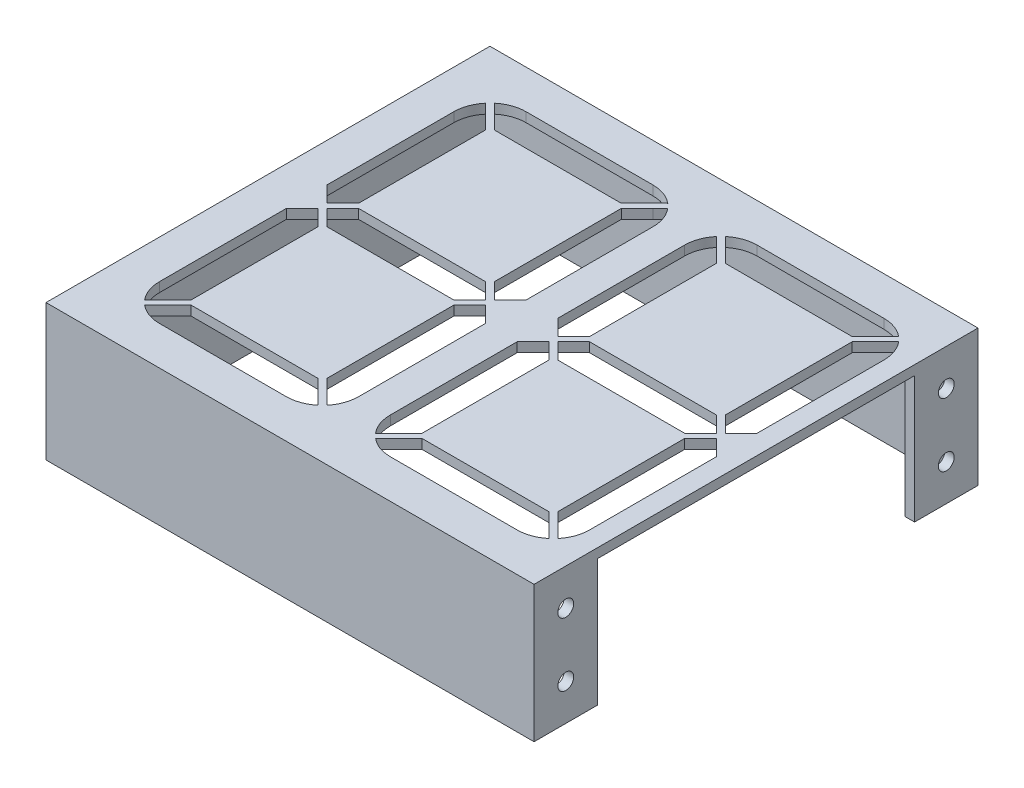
from build123d import *

# Parameters (mm, degrees)
SALIENTE_EXTRUIR4_DEPTH = 3
SALIENTE_EXTRUIR5_DEPTH = 40
CROQUIS4_R              = 2.5
CORTAR_EXTRUIR2_DEPTH   = 3


with BuildPart() as part:
    # Croquis2 → Saliente-Extruir4 (new body)
    with BuildSketch(Plane(origin=(0, 0, 0), x_dir=(1, 0, 0), z_dir=(0, 1, 0))):
        Polygon((-80, 0), (-80, 69.99998238), (73.913458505, 69.99998238), (73.913458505, -69.99998238), (-80, -69.99998238), align=None)
        Polygon((-16.41, 5), (-56.41, 5), (-61.41, 0), (-56.41, -5), (-16.41, -5), (-11.41, 0), align=None, mode=Mode.SUBTRACT)
        with BuildLine():
            Line((-14.995784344, 6.414213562), (-9.995784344, 1.414213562))
            Line((-9.995784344, 1.414213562), (-4.993086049, 6.410002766))
            Line((-4.993086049, 6.410002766), (-4.993086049, 46.403088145))
            ThreePointArc((-4.993086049, 46.403088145), (-5.681536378, 50.307699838), (-7.663858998, 53.741408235))
            Line((-7.663858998, 53.741408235), (-9.995784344, 51.412703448))
            Line((-9.995784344, 51.412703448), (-14.995784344, 46.412703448))
            Line((-14.995784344, 46.412703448), (-14.995784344, 6.414213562))
        make_face(mode=Mode.SUBTRACT)
        with BuildLine():
            Line((-57.824213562, 46.412703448), (-57.824213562, 6.414213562))
            Line((-57.824213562, 6.414213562), (-62.824213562, 1.414213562))
            Line((-62.824213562, 1.414213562), (-67.823458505, 6.413458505))
            Line((-67.823458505, 6.413458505), (-67.823458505, 46.413458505))
            ThreePointArc((-67.823458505, 46.413458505), (-67.135816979, 50.314019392), (-65.155801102, 53.744290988))
            Line((-65.155801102, 53.744290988), (-62.824213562, 51.412703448))
            Line((-62.824213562, 51.412703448), (-57.824213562, 46.412703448))
        make_face(mode=Mode.SUBTRACT)
        with BuildLine():
            Line((-14.99578434, -6.407294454), (-9.99578434, -1.407294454))
            Line((-9.99578434, -1.407294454), (-4.996536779, -6.41345589))
            Line((-4.996536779, -6.41345589), (-4.996515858, -46.406505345))
            ThreePointArc((-4.996515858, -46.406505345), (-5.683843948, -50.307429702), (-7.663049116, -53.738519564))
            Line((-7.663049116, -53.738519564), (-9.99578434, -51.40578434))
            Line((-9.99578434, -51.40578434), (-14.99578434, -46.40578434))
            Line((-14.99578434, -46.40578434), (-14.99578434, -6.407294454))
        make_face(mode=Mode.SUBTRACT)
        with BuildLine():
            Line((-57.817239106, -6.414206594), (-62.817244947, -1.414200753))
            Line((-62.817244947, -1.414200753), (-67.816496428, -6.413452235))
            Line((-67.816496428, -6.413452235), (-67.816485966, -46.413452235))
            ThreePointArc((-67.816485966, -46.413452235), (-67.128843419, -50.314012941), (-65.148826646, -53.74428402))
            Line((-65.148826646, -53.74428402), (-62.817239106, -51.41269648))
            Line((-62.817239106, -51.41269648), (-57.817239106, -46.41269648))
            Line((-57.817239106, -46.41269648), (-57.817239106, -6.414206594))
        make_face(mode=Mode.SUBTRACT)
        with BuildLine():
            Line((-11.409971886, -52.819968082), (-16.409971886, -47.819968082))
            Line((-16.409971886, -47.819968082), (-56.409971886, -47.819968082))
            Line((-56.409971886, -47.819968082), (-61.409971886, -52.819968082))
            Line((-61.409971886, -52.819968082), (-63.741625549, -55.151621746))
            ThreePointArc((-63.741625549, -55.151621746), (-60.311022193, -57.132162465), (-56.409936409, -57.819992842))
            Line((-56.409936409, -57.819992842), (-16.40997049, -57.819971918))
            ThreePointArc((-16.40997049, -57.819971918), (-12.50856319, -57.132463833), (-9.077170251, -55.152769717))
            Line((-9.077170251, -55.152769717), (-11.409971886, -52.819968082))
        make_face(mode=Mode.SUBTRACT)
        with BuildLine():
            Line((-16.416914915, 47.820002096), (-11.416914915, 52.820002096))
            Line((-11.416914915, 52.820002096), (-9.07863101, 55.15505666))
            ThreePointArc((-9.07863101, 55.15505666), (-12.509650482, 57.133102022), (-16.41, 57.820002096))
            Line((-16.41, 57.820002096), (-56.416914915, 57.820002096))
            ThreePointArc((-56.416914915, 57.820002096), (-60.317979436, 57.132177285), (-63.748568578, 55.151655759))
            Line((-63.748568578, 55.151655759), (-61.416914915, 52.820002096))
            Line((-61.416914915, 52.820002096), (-56.416914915, 47.820002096))
            Line((-56.416914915, 47.820002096), (-16.416914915, 47.820002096))
        make_face(mode=Mode.SUBTRACT)
        with BuildLine():
            Line((9.99578434, -1.407294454), (4.996536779, -6.41345589))
            Line((4.996536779, -6.41345589), (4.996515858, -46.406505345))
            ThreePointArc((4.996515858, -46.406505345), (5.683843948, -50.307429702), (7.663049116, -53.738519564))
            Line((7.663049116, -53.738519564), (9.99578434, -51.40578434))
            Line((9.99578434, -51.40578434), (14.99578434, -46.40578434))
            Line((14.99578434, -46.40578434), (14.99578434, -6.407294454))
            Line((14.99578434, -6.407294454), (9.99578434, -1.407294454))
        make_face(mode=Mode.SUBTRACT)
        with BuildLine():
            Line((9.995784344, 1.414213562), (4.993086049, 6.410002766))
            Line((4.993086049, 6.410002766), (4.993086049, 46.403088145))
            ThreePointArc((4.993086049, 46.403088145), (5.681536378, 50.307699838), (7.663858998, 53.741408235))
            Line((7.663858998, 53.741408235), (9.995784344, 51.412703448))
            Line((9.995784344, 51.412703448), (14.995784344, 46.412703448))
            Line((14.995784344, 46.412703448), (14.995784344, 6.414213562))
            Line((14.995784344, 6.414213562), (9.995784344, 1.414213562))
        make_face(mode=Mode.SUBTRACT)
        with BuildLine():
            Line((62.817244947, -1.414200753), (67.816496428, -6.413452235))
            Line((67.816496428, -6.413452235), (67.816485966, -46.413452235))
            ThreePointArc((67.816485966, -46.413452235), (67.128843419, -50.314012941), (65.148826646, -53.74428402))
            Line((65.148826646, -53.74428402), (62.817239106, -51.41269648))
            Line((62.817239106, -51.41269648), (57.817239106, -46.41269648))
            Line((57.817239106, -46.41269648), (57.817239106, -6.414206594))
            Line((57.817239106, -6.414206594), (62.817244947, -1.414200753))
        make_face(mode=Mode.SUBTRACT)
        with BuildLine():
            Line((62.824213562, 1.414213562), (67.823458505, 6.413458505))
            Line((67.823458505, 6.413458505), (67.823458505, 46.413458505))
            ThreePointArc((67.823458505, 46.413458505), (67.135816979, 50.314019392), (65.155801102, 53.744290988))
            Line((65.155801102, 53.744290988), (62.824213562, 51.412703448))
            Line((62.824213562, 51.412703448), (57.824213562, 46.412703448))
            Line((57.824213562, 46.412703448), (57.824213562, 6.414213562))
            Line((57.824213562, 6.414213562), (62.824213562, 1.414213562))
        make_face(mode=Mode.SUBTRACT)
        with BuildLine():
            Line((11.409971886, -52.819968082), (9.077170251, -55.152769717))
            ThreePointArc((9.077170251, -55.152769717), (12.50856319, -57.132463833), (16.40997049, -57.819971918))
            Line((16.40997049, -57.819971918), (56.409936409, -57.819992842))
            ThreePointArc((56.409936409, -57.819992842), (60.311022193, -57.132162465), (63.741625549, -55.151621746))
            Line((63.741625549, -55.151621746), (61.409971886, -52.819968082))
            Line((61.409971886, -52.819968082), (56.409971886, -47.819968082))
            Line((56.409971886, -47.819968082), (16.409971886, -47.819968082))
            Line((16.409971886, -47.819968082), (11.409971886, -52.819968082))
        make_face(mode=Mode.SUBTRACT)
        with BuildLine():
            Line((61.416914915, 52.820002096), (63.748568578, 55.151655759))
            ThreePointArc((63.748568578, 55.151655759), (60.317979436, 57.132177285), (56.416914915, 57.820002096))
            Line((56.416914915, 57.820002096), (16.41, 57.820002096))
            ThreePointArc((16.41, 57.820002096), (12.509650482, 57.133102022), (9.07863101, 55.15505666))
            Line((9.07863101, 55.15505666), (11.416914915, 52.820002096))
            Line((11.416914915, 52.820002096), (16.416914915, 47.820002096))
            Line((16.416914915, 47.820002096), (56.416914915, 47.820002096))
            Line((56.416914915, 47.820002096), (61.416914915, 52.820002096))
        make_face(mode=Mode.SUBTRACT)
        Polygon((61.41, 0), (56.41, -5), (16.41, -5), (11.41, 0), (16.41, 5), (56.41, 5), align=None, mode=Mode.SUBTRACT)
    extrude(amount=SALIENTE_EXTRUIR4_DEPTH)

    # Croquis3 → Saliente-Extruir5 (add)
    with BuildSketch(Plane(origin=(0, 0, 0), x_dir=(-1, 0, 0), z_dir=(0, -1, 0))):
        Polygon((80, -69.99998238), (-73.913458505, -69.99998238), (-73.913458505, -49.99998238), (-70.913458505, -49.99998238), (-70.913458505, -66.99998238), (77, -66.99998238), (77, 66.99998238), (-70.913458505, 66.99998238), (-70.913458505, 49.99998238), (-73.913458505, 49.99998238), (-73.913458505, 69.99998238), (80, 69.99998238), align=None)
    extrude(amount=SALIENTE_EXTRUIR5_DEPTH)

    # Croquis4 → Cortar-Extruir2 (cut)
    with BuildSketch(Plane(origin=(73.913458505, 0, 0), x_dir=(0, 0, -1), z_dir=(1, 0, 0))):
        with Locations((-59.99998238, -8.5)):
            Circle(CROQUIS4_R)
        with Locations((-59.99998238, -28.5)):
            Circle(CROQUIS4_R)
        with Locations((59.99998238, -8.5)):
            Circle(CROQUIS4_R)
        with Locations((59.99998238, -28.5)):
            Circle(CROQUIS4_R)
    extrude(amount=-CORTAR_EXTRUIR2_DEPTH, mode=Mode.SUBTRACT)


solid = part.part
